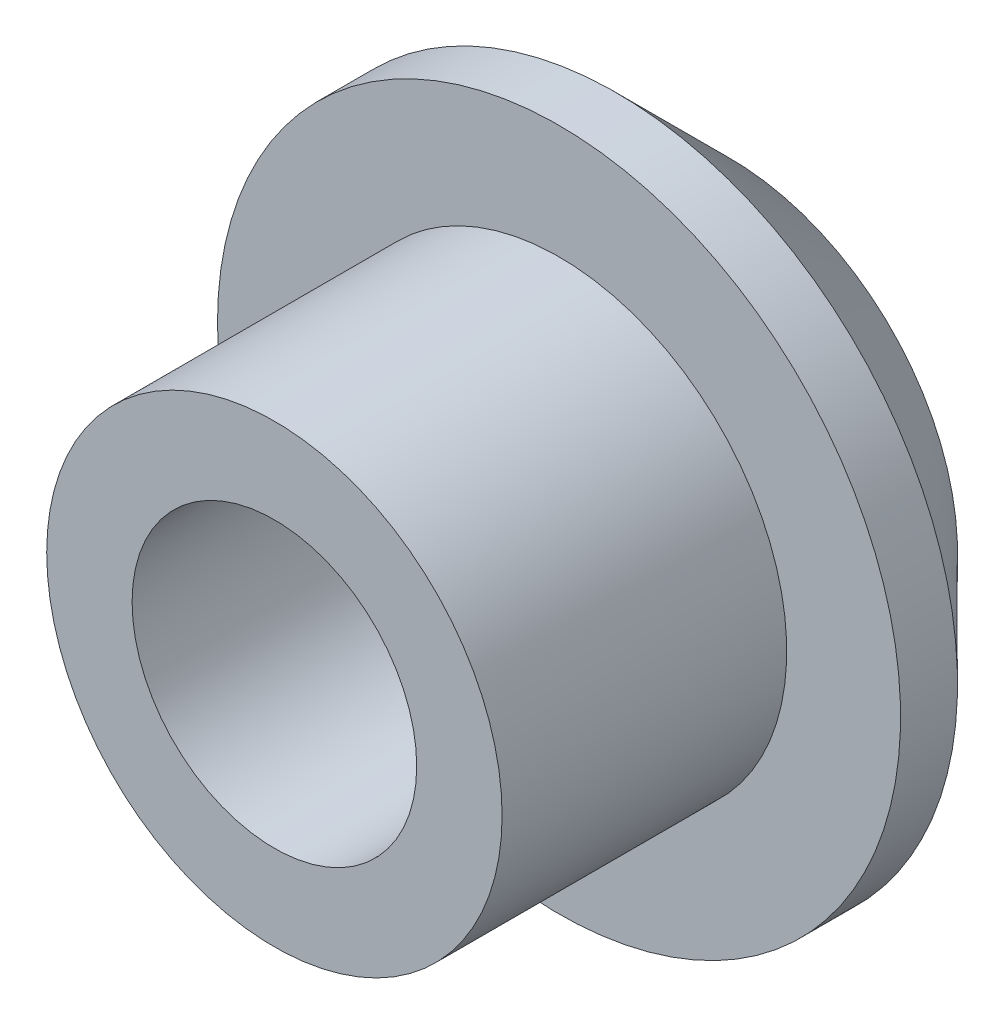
ISO-10303-21;
HEADER;
FILE_DESCRIPTION(('STEP AP214'),'2;1');
FILE_NAME('part.step','',(''),(''),'','','');
FILE_SCHEMA(('AUTOMOTIVE_DESIGN { 1 0 10303 214 1 1 1 1 }'));
ENDSEC;
DATA;
#1=APPLICATION_CONTEXT('core data for automotive mechanical design processes');
#2=APPLICATION_PROTOCOL_DEFINITION('international standard','automotive_design',2000,#1);
#3=PRODUCT_CONTEXT('',#1,'mechanical');
#4=PRODUCT('Part','Part','',(#3));
#5=PRODUCT_RELATED_PRODUCT_CATEGORY('part','',(#4));
#6=PRODUCT_DEFINITION_FORMATION('','',#4);
#7=PRODUCT_DEFINITION_CONTEXT('part definition',#1,'design');
#8=PRODUCT_DEFINITION('design','',#6,#7);
#9=PRODUCT_DEFINITION_SHAPE('','',#8);
#10=(LENGTH_UNIT() NAMED_UNIT(*) SI_UNIT(.MILLI.,.METRE.));
#11=(NAMED_UNIT(*) PLANE_ANGLE_UNIT() SI_UNIT($,.RADIAN.));
#12=(NAMED_UNIT(*) SI_UNIT($,.STERADIAN.) SOLID_ANGLE_UNIT());
#13=UNCERTAINTY_MEASURE_WITH_UNIT(LENGTH_MEASURE(1.E-05),#10,'distance_accuracy_value','');
#14=(GEOMETRIC_REPRESENTATION_CONTEXT(3) GLOBAL_UNCERTAINTY_ASSIGNED_CONTEXT((#13)) GLOBAL_UNIT_ASSIGNED_CONTEXT((#10,
#11,#12)) REPRESENTATION_CONTEXT('',''));
#15=CARTESIAN_POINT('',(0.,0.,0.));
#16=DIRECTION('',(0.,0.,1.));
#17=DIRECTION('',(1.,0.,0.));
#18=AXIS2_PLACEMENT_3D('',#15,#16,#17);
#19=CARTESIAN_POINT('',(0.,0.,5.));
#20=DIRECTION('',(0.,0.,-1.));
#21=DIRECTION('',(-1.,0.,0.));
#22=AXIS2_PLACEMENT_3D('',#19,#20,#21);
#23=CYLINDRICAL_SURFACE('',#22,4.);
#24=CARTESIAN_POINT('',(0.,0.,5.));
#25=DIRECTION('',(0.,0.,1.));
#26=DIRECTION('',(1.,0.,0.));
#27=AXIS2_PLACEMENT_3D('',#24,#25,#26);
#28=CIRCLE('',#27,4.);
#29=CARTESIAN_POINT('',(4.,0.,5.));
#30=VERTEX_POINT('',#29);
#31=EDGE_CURVE('E43',#30,#30,#28,.T.);
#32=ORIENTED_EDGE('',*,*,#31,.F.);
#33=EDGE_LOOP('',(#32));
#34=FACE_BOUND('',#33,.T.);
#35=CARTESIAN_POINT('',(0.,0.,0.));
#36=DIRECTION('',(0.,0.,-1.));
#37=DIRECTION('',(-1.,0.,0.));
#38=AXIS2_PLACEMENT_3D('',#35,#36,#37);
#39=CIRCLE('',#38,4.);
#40=CARTESIAN_POINT('',(-4.,0.,0.));
#41=VERTEX_POINT('',#40);
#42=EDGE_CURVE('E47',#41,#41,#39,.T.);
#43=ORIENTED_EDGE('',*,*,#42,.F.);
#44=EDGE_LOOP('',(#43));
#45=FACE_BOUND('',#44,.T.);
#46=ADVANCED_FACE('F32',(#34,#45),#23,.T.);
#47=CARTESIAN_POINT('',(0.,0.,5.));
#48=DIRECTION('',(0.,0.,1.));
#49=DIRECTION('',(1.,0.,0.));
#50=AXIS2_PLACEMENT_3D('',#47,#48,#49);
#51=PLANE('',#50);
#52=CARTESIAN_POINT('',(0.,0.,5.));
#53=DIRECTION('',(0.,0.,-1.));
#54=DIRECTION('',(-1.,0.,0.));
#55=AXIS2_PLACEMENT_3D('',#52,#53,#54);
#56=CIRCLE('',#55,2.5);
#57=CARTESIAN_POINT('',(-2.5,0.,5.));
#58=VERTEX_POINT('',#57);
#59=EDGE_CURVE('E55',#58,#58,#56,.T.);
#60=ORIENTED_EDGE('',*,*,#59,.T.);
#61=EDGE_LOOP('',(#60));
#62=FACE_BOUND('',#61,.T.);
#63=ORIENTED_EDGE('',*,*,#31,.T.);
#64=EDGE_LOOP('',(#63));
#65=FACE_BOUND('',#64,.T.);
#66=ADVANCED_FACE('F75',(#62,#65),#51,.T.);
#67=CARTESIAN_POINT('',(0.,0.,-3.));
#68=DIRECTION('',(0.,0.,1.));
#69=DIRECTION('',(1.,0.,0.));
#70=AXIS2_PLACEMENT_3D('',#67,#68,#69);
#71=CYLINDRICAL_SURFACE('',#70,6.);
#72=CARTESIAN_POINT('',(0.,0.,-0.999999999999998));
#73=DIRECTION('',(0.,0.,-1.));
#74=DIRECTION('',(-1.,0.,0.));
#75=AXIS2_PLACEMENT_3D('',#72,#73,#74);
#76=CIRCLE('',#75,6.);
#77=CARTESIAN_POINT('',(-6.,0.,-0.999999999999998));
#78=VERTEX_POINT('',#77);
#79=EDGE_CURVE('E10',#78,#78,#76,.F.);
#80=ORIENTED_EDGE('',*,*,#79,.T.);
#81=EDGE_LOOP('',(#80));
#82=FACE_BOUND('',#81,.T.);
#83=CARTESIAN_POINT('',(0.,0.,0.));
#84=DIRECTION('',(0.,0.,-1.));
#85=DIRECTION('',(-1.,0.,0.));
#86=AXIS2_PLACEMENT_3D('',#83,#84,#85);
#87=CIRCLE('',#86,6.);
#88=CARTESIAN_POINT('',(-6.,0.,0.));
#89=VERTEX_POINT('',#88);
#90=EDGE_CURVE('E52',#89,#89,#87,.T.);
#91=ORIENTED_EDGE('',*,*,#90,.T.);
#92=EDGE_LOOP('',(#91));
#93=FACE_BOUND('',#92,.T.);
#94=ADVANCED_FACE('F67',(#82,#93),#71,.T.);
#95=CARTESIAN_POINT('',(0.,0.,-3.));
#96=DIRECTION('',(0.,0.,-1.));
#97=DIRECTION('',(-1.,0.,0.));
#98=AXIS2_PLACEMENT_3D('',#95,#96,#97);
#99=PLANE('',#98);
#100=CARTESIAN_POINT('',(0.,0.,-3.));
#101=DIRECTION('',(0.,0.,-1.));
#102=DIRECTION('',(-1.,0.,0.));
#103=AXIS2_PLACEMENT_3D('',#100,#101,#102);
#104=CIRCLE('',#103,4.00000000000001);
#105=CARTESIAN_POINT('',(-4.00000000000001,0.,-3.));
#106=VERTEX_POINT('',#105);
#107=EDGE_CURVE('E39',#106,#106,#104,.T.);
#108=ORIENTED_EDGE('',*,*,#107,.T.);
#109=EDGE_LOOP('',(#108));
#110=FACE_BOUND('',#109,.T.);
#111=CARTESIAN_POINT('',(0.,0.,-3.));
#112=DIRECTION('',(0.,0.,-1.));
#113=DIRECTION('',(-1.,0.,0.));
#114=AXIS2_PLACEMENT_3D('',#111,#112,#113);
#115=CIRCLE('',#114,2.49999999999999);
#116=CARTESIAN_POINT('',(-2.49999999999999,0.,-3.));
#117=VERTEX_POINT('',#116);
#118=EDGE_CURVE('E58',#117,#117,#115,.T.);
#119=ORIENTED_EDGE('',*,*,#118,.F.);
#120=EDGE_LOOP('',(#119));
#121=FACE_BOUND('',#120,.T.);
#122=ADVANCED_FACE('F64',(#110,#121),#99,.T.);
#123=CARTESIAN_POINT('',(0.,0.,0.));
#124=DIRECTION('',(0.,0.,-1.));
#125=DIRECTION('',(-1.,0.,0.));
#126=AXIS2_PLACEMENT_3D('',#123,#124,#125);
#127=PLANE('',#126);
#128=ORIENTED_EDGE('',*,*,#42,.T.);
#129=EDGE_LOOP('',(#128));
#130=FACE_BOUND('',#129,.T.);
#131=ORIENTED_EDGE('',*,*,#90,.F.);
#132=EDGE_LOOP('',(#131));
#133=FACE_BOUND('',#132,.T.);
#134=ADVANCED_FACE('F66',(#130,#133),#127,.F.);
#135=CARTESIAN_POINT('',(0.,0.,-3.));
#136=DIRECTION('',(0.,0.,-1.));
#137=DIRECTION('',(-1.,0.,0.));
#138=AXIS2_PLACEMENT_3D('',#135,#136,#137);
#139=CYLINDRICAL_SURFACE('',#138,2.49999999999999);
#140=ORIENTED_EDGE('',*,*,#59,.F.);
#141=EDGE_LOOP('',(#140));
#142=FACE_BOUND('',#141,.T.);
#143=ORIENTED_EDGE('',*,*,#118,.T.);
#144=EDGE_LOOP('',(#143));
#145=FACE_BOUND('',#144,.T.);
#146=ADVANCED_FACE('F62',(#142,#145),#139,.F.);
#147=CARTESIAN_POINT('',(0.,0.,-3.));
#148=DIRECTION('',(0.,0.,1.));
#149=DIRECTION('',(1.,0.,0.));
#150=AXIS2_PLACEMENT_3D('',#147,#148,#149);
#151=CONICAL_SURFACE('',#150,4.00000000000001,0.785398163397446);
#152=ORIENTED_EDGE('',*,*,#79,.F.);
#153=EDGE_LOOP('',(#152));
#154=FACE_BOUND('',#153,.T.);
#155=ORIENTED_EDGE('',*,*,#107,.F.);
#156=EDGE_LOOP('',(#155));
#157=FACE_BOUND('',#156,.T.);
#158=ADVANCED_FACE('F34',(#154,#157),#151,.T.);
#159=CLOSED_SHELL('',(#46,#66,#94,#122,#134,#146,#158));
#160=MANIFOLD_SOLID_BREP('B2',#159);
#161=ADVANCED_BREP_SHAPE_REPRESENTATION('',(#18,#160),#14);
#162=SHAPE_DEFINITION_REPRESENTATION(#9,#161);
ENDSEC;
END-ISO-10303-21;
